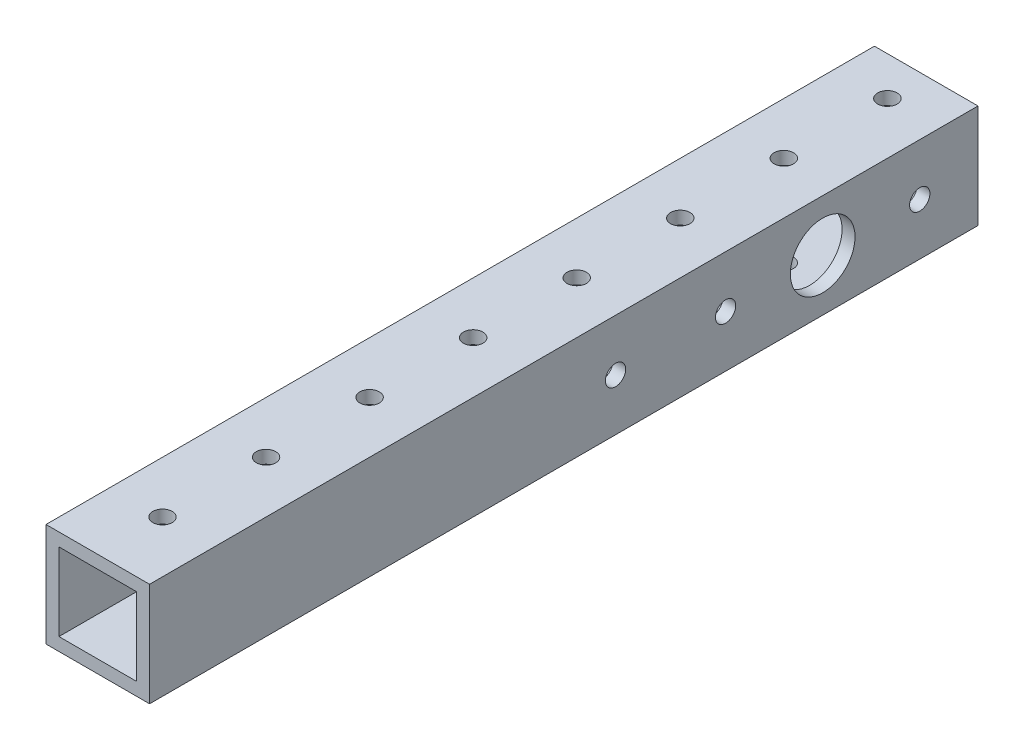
from build123d import *

# Parameters (mm, degrees)
SKETCH1_W           = 25.4
SKETCH1_H           = 25.4
SKETCH1_W_2         = 19.05
SKETCH1_H_2         = 19.05
BOSS_EXTRUDE1_DEPTH = 101.6
SKETCH2_R           = 2.4892
SKETCH2_R_2         = 7.9375
CUT_EXTRUDE1_DEPTH  = 106.494123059
SKETCH3_R           = 2.38125
CUT_EXTRUDE2_DEPTH  = 106.494123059
LPATTERN1_COUNT     = 8
LPATTERN1_PITCH     = 25.4
CUT_EXTRUDE3_REACH  = 107.494
SKETCH4_R           = 4.7625
CUT_EXTRUDE4_REACH  = 106.775
SKETCH5_R           = 4.7625


with BuildPart() as part:
    # Sketch1 → Boss-Extrude1 (new, symmetric)
    with BuildSketch(Plane.XY):
        Rectangle(SKETCH1_W, SKETCH1_H)
        Rectangle(SKETCH1_W_2, SKETCH1_H_2, mode=Mode.SUBTRACT)
    extrude(amount=BOSS_EXTRUDE1_DEPTH, both=True)

    # Sketch2 → Cut-Extrude1 (cut, through all)
    with BuildSketch(Plane(origin=(12.7, 0, 0), x_dir=(0, 0, -1), z_dir=(1, 0, 0))):
        with Locations((12.7, 0)):
            Circle(SKETCH2_R)
        with Locations((39.6875, 0)):
            Circle(SKETCH2_R)
        with Locations((63.5, 0)):
            Circle(SKETCH2_R_2)
        with Locations((87.3125, 0)):
            Circle(SKETCH2_R)
    extrude(amount=-CUT_EXTRUDE1_DEPTH, mode=Mode.SUBTRACT)

    # Sketch3 → Cut-Extrude2 (cut, through all)
    with BuildSketch(Plane(origin=(0, 12.7, 0), x_dir=(1, 0, 0), z_dir=(0, 1, 0))):
        with Locations(Location((0, 92.075, 0), (0, 0, 270))):
            Circle(SKETCH3_R)
    cut_extrude2 = extrude(amount=-CUT_EXTRUDE2_DEPTH, mode=Mode.SUBTRACT)

    # LPattern1: Cut-Extrude2 ×8
    with Locations(*[(0, 0, i * LPATTERN1_PITCH) for i in range(1, LPATTERN1_COUNT)]):
        add(cut_extrude2, mode=Mode.SUBTRACT)

    # Sketch4 → Cut-Extrude3 (cut, up to next)
    with BuildSketch(Plane.ZY.offset(12.7), mode=Mode.PRIVATE) as cut_extrude3_sk1:
        with Locations((-87.3125, 0)):
            Circle(SKETCH4_R)
    cut_extrude3_tool1 = extrude(cut_extrude3_sk1.sketch, amount=-CUT_EXTRUDE3_REACH, mode=Mode.PRIVATE) & part.part
    # Sketch4 → Cut-Extrude3 (cut, up to next)
    with BuildSketch(Plane.ZY.offset(12.7), mode=Mode.PRIVATE) as cut_extrude3_sk2:
        with Locations((-39.6875, 0)):
            Circle(SKETCH4_R)
    cut_extrude3_tool2 = extrude(cut_extrude3_sk2.sketch, amount=-CUT_EXTRUDE3_REACH, mode=Mode.PRIVATE) & part.part
    add(cut_extrude3_tool1.solids().sort_by_distance((-12.7, 0, -87.3125))[0], mode=Mode.SUBTRACT)
    add(cut_extrude3_tool2.solids().sort_by_distance((-12.7, 0, -39.6875))[0], mode=Mode.SUBTRACT)

    # Sketch5 → Cut-Extrude4 (cut, up to next)
    with BuildSketch(Plane(origin=(-9.525, 0, 0), x_dir=(0, 0, -1), z_dir=(1, 0, 0)), mode=Mode.PRIVATE) as cut_extrude4_sk1:
        with Locations((12.7, 0)):
            Circle(SKETCH5_R)
    cut_extrude4_tool1 = extrude(cut_extrude4_sk1.sketch, amount=-CUT_EXTRUDE4_REACH, mode=Mode.PRIVATE) & part.part
    add(cut_extrude4_tool1.solids().sort_by_distance((-9.525, 0, -12.7))[0], mode=Mode.SUBTRACT)


solid = part.part
